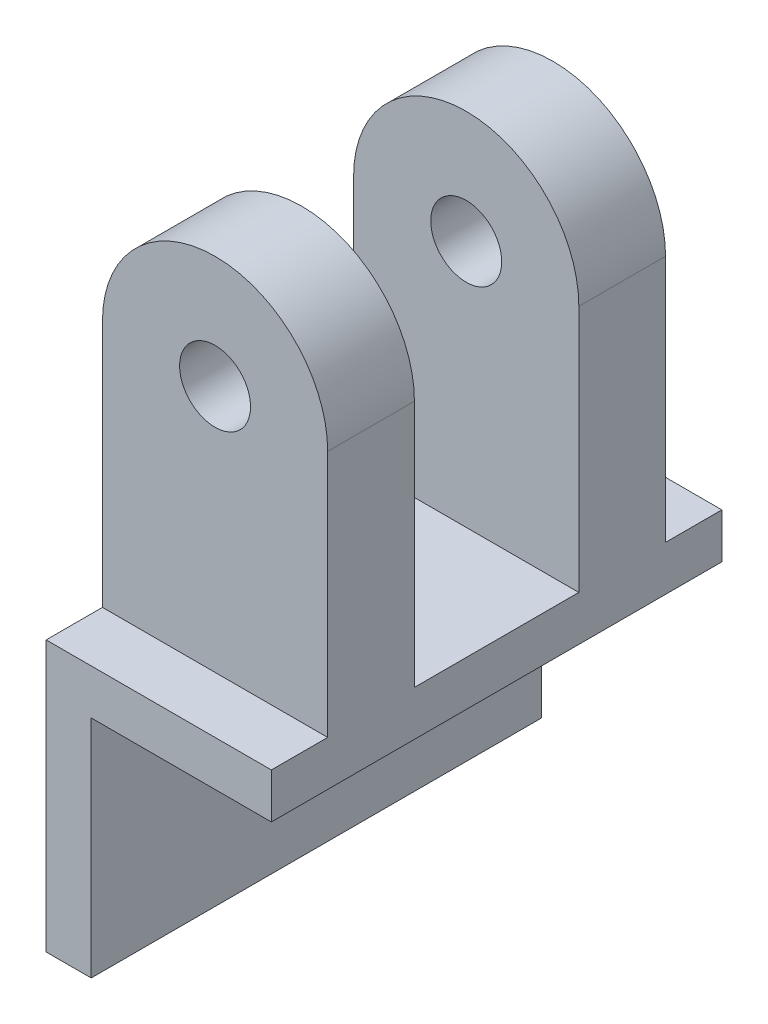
ISO-10303-21;
HEADER;
FILE_DESCRIPTION(('STEP AP214'),'2;1');
FILE_NAME('part.step','',(''),(''),'','','');
FILE_SCHEMA(('AUTOMOTIVE_DESIGN { 1 0 10303 214 1 1 1 1 }'));
ENDSEC;
DATA;
#1=APPLICATION_CONTEXT('core data for automotive mechanical design processes');
#2=APPLICATION_PROTOCOL_DEFINITION('international standard','automotive_design',2000,#1);
#3=PRODUCT_CONTEXT('',#1,'mechanical');
#4=PRODUCT('Part','Part','',(#3));
#5=PRODUCT_RELATED_PRODUCT_CATEGORY('part','',(#4));
#6=PRODUCT_DEFINITION_FORMATION('','',#4);
#7=PRODUCT_DEFINITION_CONTEXT('part definition',#1,'design');
#8=PRODUCT_DEFINITION('design','',#6,#7);
#9=PRODUCT_DEFINITION_SHAPE('','',#8);
#10=(LENGTH_UNIT() NAMED_UNIT(*) SI_UNIT(.MILLI.,.METRE.));
#11=(NAMED_UNIT(*) PLANE_ANGLE_UNIT() SI_UNIT($,.RADIAN.));
#12=(NAMED_UNIT(*) SI_UNIT($,.STERADIAN.) SOLID_ANGLE_UNIT());
#13=UNCERTAINTY_MEASURE_WITH_UNIT(LENGTH_MEASURE(1.E-05),#10,'distance_accuracy_value','');
#14=(GEOMETRIC_REPRESENTATION_CONTEXT(3) GLOBAL_UNCERTAINTY_ASSIGNED_CONTEXT((#13)) GLOBAL_UNIT_ASSIGNED_CONTEXT((#10,
#11,#12)) REPRESENTATION_CONTEXT('',''));
#15=CARTESIAN_POINT('',(0.,0.,0.));
#16=DIRECTION('',(0.,0.,1.));
#17=DIRECTION('',(1.,0.,0.));
#18=AXIS2_PLACEMENT_3D('',#15,#16,#17);
#19=CARTESIAN_POINT('',(12.7,5.08,25.4));
#20=DIRECTION('',(0.,-1.,0.));
#21=DIRECTION('',(1.,0.,0.));
#22=AXIS2_PLACEMENT_3D('',#19,#20,#21);
#23=PLANE('',#22);
#24=DIRECTION('',(1.,0.,0.));
#25=VECTOR('',#24,1.);
#26=CARTESIAN_POINT('',(12.7,5.08,19.05));
#27=LINE('',#26,#25);
#28=CARTESIAN_POINT('',(-12.7,5.07999999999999,19.05));
#29=VERTEX_POINT('',#28);
#30=CARTESIAN_POINT('',(12.7,5.07999999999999,19.05));
#31=VERTEX_POINT('',#30);
#32=EDGE_CURVE('E11',#29,#31,#27,.T.);
#33=ORIENTED_EDGE('',*,*,#32,.F.);
#34=DIRECTION('',(0.,0.,-1.));
#35=VECTOR('',#34,1.);
#36=CARTESIAN_POINT('',(-12.7,5.07999999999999,25.4));
#37=LINE('',#36,#35);
#38=CARTESIAN_POINT('',(-12.7,5.07999999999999,25.4));
#39=VERTEX_POINT('',#38);
#40=EDGE_CURVE('E200',#39,#29,#37,.T.);
#41=ORIENTED_EDGE('',*,*,#40,.F.);
#42=DIRECTION('',(-1.,0.,0.));
#43=VECTOR('',#42,1.);
#44=CARTESIAN_POINT('',(12.7,5.08,25.4));
#45=LINE('',#44,#43);
#46=CARTESIAN_POINT('',(12.7,5.08,25.4));
#47=VERTEX_POINT('',#46);
#48=EDGE_CURVE('E167',#47,#39,#45,.T.);
#49=ORIENTED_EDGE('',*,*,#48,.F.);
#50=DIRECTION('',(0.,0.,-1.));
#51=VECTOR('',#50,1.);
#52=CARTESIAN_POINT('',(12.7,5.08,25.4));
#53=LINE('',#52,#51);
#54=EDGE_CURVE('E205',#47,#31,#53,.T.);
#55=ORIENTED_EDGE('',*,*,#54,.T.);
#56=EDGE_LOOP('',(#33,#41,#49,#55));
#57=FACE_BOUND('',#56,.T.);
#58=ADVANCED_FACE('F34',(#57),#23,.F.);
#59=CARTESIAN_POINT('',(0.,33.02,-19.05));
#60=DIRECTION('',(0.,0.,-1.));
#61=DIRECTION('',(-1.,0.,0.));
#62=AXIS2_PLACEMENT_3D('',#59,#60,#61);
#63=PLANE('',#62);
#64=CARTESIAN_POINT('',(0.,33.02,-19.05));
#65=DIRECTION('',(0.,0.,1.));
#66=DIRECTION('',(1.,0.,0.));
#67=AXIS2_PLACEMENT_3D('',#64,#65,#66);
#68=CIRCLE('',#67,4.0005);
#69=CARTESIAN_POINT('',(-4.0005,33.02,-19.05));
#70=VERTEX_POINT('',#69);
#71=EDGE_CURVE('E210',#70,#70,#68,.T.);
#72=ORIENTED_EDGE('',*,*,#71,.T.);
#73=EDGE_LOOP('',(#72));
#74=FACE_BOUND('',#73,.T.);
#75=DIRECTION('',(0.,1.,0.));
#76=VECTOR('',#75,1.);
#77=CARTESIAN_POINT('',(12.7,33.02,-19.05));
#78=LINE('',#77,#76);
#79=CARTESIAN_POINT('',(12.7,5.07999999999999,-19.05));
#80=VERTEX_POINT('',#79);
#81=CARTESIAN_POINT('',(12.7,33.02,-19.05));
#82=VERTEX_POINT('',#81);
#83=EDGE_CURVE('E57',#80,#82,#78,.T.);
#84=ORIENTED_EDGE('',*,*,#83,.F.);
#85=DIRECTION('',(-1.,0.,0.));
#86=VECTOR('',#85,1.);
#87=CARTESIAN_POINT('',(0.,5.07999999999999,-19.05));
#88=LINE('',#87,#86);
#89=CARTESIAN_POINT('',(-12.7,5.07999999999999,-19.05));
#90=VERTEX_POINT('',#89);
#91=EDGE_CURVE('E208',#80,#90,#88,.T.);
#92=ORIENTED_EDGE('',*,*,#91,.T.);
#93=DIRECTION('',(0.,-1.,0.));
#94=VECTOR('',#93,1.);
#95=CARTESIAN_POINT('',(-12.7,0.,-19.05));
#96=LINE('',#95,#94);
#97=CARTESIAN_POINT('',(-12.7,33.02,-19.05));
#98=VERTEX_POINT('',#97);
#99=EDGE_CURVE('E211',#98,#90,#96,.T.);
#100=ORIENTED_EDGE('',*,*,#99,.F.);
#101=CARTESIAN_POINT('',(0.,33.02,-19.05));
#102=DIRECTION('',(0.,0.,1.));
#103=DIRECTION('',(-1.,0.,0.));
#104=AXIS2_PLACEMENT_3D('',#101,#102,#103);
#105=CIRCLE('',#104,12.7);
#106=EDGE_CURVE('E216',#82,#98,#105,.T.);
#107=ORIENTED_EDGE('',*,*,#106,.F.);
#108=EDGE_LOOP('',(#84,#92,#100,#107));
#109=FACE_BOUND('',#108,.T.);
#110=ADVANCED_FACE('F288',(#74,#109),#63,.T.);
#111=CARTESIAN_POINT('',(12.7,0.,19.05));
#112=DIRECTION('',(0.,1.,0.));
#113=DIRECTION('',(0.,0.,1.));
#114=AXIS2_PLACEMENT_3D('',#111,#112,#113);
#115=PLANE('',#114);
#116=DIRECTION('',(1.,0.,0.));
#117=VECTOR('',#116,1.);
#118=CARTESIAN_POINT('',(-7.62,0.,-25.4));
#119=LINE('',#118,#117);
#120=CARTESIAN_POINT('',(-7.62,0.,-25.4));
#121=VERTEX_POINT('',#120);
#122=CARTESIAN_POINT('',(12.7,0.,-25.4));
#123=VERTEX_POINT('',#122);
#124=EDGE_CURVE('E168',#121,#123,#119,.T.);
#125=ORIENTED_EDGE('',*,*,#124,.T.);
#126=DIRECTION('',(0.,0.,-1.));
#127=VECTOR('',#126,1.);
#128=CARTESIAN_POINT('',(12.7,0.,19.05));
#129=LINE('',#128,#127);
#130=CARTESIAN_POINT('',(12.7,0.,25.4));
#131=VERTEX_POINT('',#130);
#132=EDGE_CURVE('E221',#131,#123,#129,.T.);
#133=ORIENTED_EDGE('',*,*,#132,.F.);
#134=DIRECTION('',(1.,0.,0.));
#135=VECTOR('',#134,1.);
#136=CARTESIAN_POINT('',(-7.62,0.,25.4));
#137=LINE('',#136,#135);
#138=CARTESIAN_POINT('',(-7.62,0.,25.4));
#139=VERTEX_POINT('',#138);
#140=EDGE_CURVE('E177',#139,#131,#137,.T.);
#141=ORIENTED_EDGE('',*,*,#140,.F.);
#142=DIRECTION('',(0.,0.,-1.));
#143=VECTOR('',#142,1.);
#144=CARTESIAN_POINT('',(-7.62,0.,25.4));
#145=LINE('',#144,#143);
#146=EDGE_CURVE('E179',#139,#121,#145,.T.);
#147=ORIENTED_EDGE('',*,*,#146,.T.);
#148=EDGE_LOOP('',(#125,#133,#141,#147));
#149=FACE_BOUND('',#148,.T.);
#150=ADVANCED_FACE('F272',(#149),#115,.F.);
#151=CARTESIAN_POINT('',(0.,33.02,-9.271));
#152=DIRECTION('',(0.,0.,-1.));
#153=DIRECTION('',(-1.,0.,0.));
#154=AXIS2_PLACEMENT_3D('',#151,#152,#153);
#155=PLANE('',#154);
#156=CARTESIAN_POINT('',(0.,33.02,-9.271));
#157=DIRECTION('',(0.,0.,1.));
#158=DIRECTION('',(1.,0.,0.));
#159=AXIS2_PLACEMENT_3D('',#156,#157,#158);
#160=CIRCLE('',#159,4.0005);
#161=CARTESIAN_POINT('',(-4.0005,33.02,-9.271));
#162=VERTEX_POINT('',#161);
#163=EDGE_CURVE('E214',#162,#162,#160,.T.);
#164=ORIENTED_EDGE('',*,*,#163,.F.);
#165=EDGE_LOOP('',(#164));
#166=FACE_BOUND('',#165,.T.);
#167=DIRECTION('',(-1.,0.,0.));
#168=VECTOR('',#167,1.);
#169=CARTESIAN_POINT('',(0.,5.07999999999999,-9.271));
#170=LINE('',#169,#168);
#171=CARTESIAN_POINT('',(12.7,5.07999999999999,-9.271));
#172=VERTEX_POINT('',#171);
#173=CARTESIAN_POINT('',(-12.7,5.07999999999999,-9.271));
#174=VERTEX_POINT('',#173);
#175=EDGE_CURVE('E227',#172,#174,#170,.T.);
#176=ORIENTED_EDGE('',*,*,#175,.F.);
#177=DIRECTION('',(0.,1.,0.));
#178=VECTOR('',#177,1.);
#179=CARTESIAN_POINT('',(12.7,33.02,-9.271));
#180=LINE('',#179,#178);
#181=CARTESIAN_POINT('',(12.7,33.02,-9.271));
#182=VERTEX_POINT('',#181);
#183=EDGE_CURVE('E230',#172,#182,#180,.T.);
#184=ORIENTED_EDGE('',*,*,#183,.T.);
#185=CARTESIAN_POINT('',(0.,33.02,-9.271));
#186=DIRECTION('',(0.,0.,1.));
#187=DIRECTION('',(-1.,0.,0.));
#188=AXIS2_PLACEMENT_3D('',#185,#186,#187);
#189=CIRCLE('',#188,12.7);
#190=CARTESIAN_POINT('',(-12.7,33.02,-9.271));
#191=VERTEX_POINT('',#190);
#192=EDGE_CURVE('E228',#182,#191,#189,.T.);
#193=ORIENTED_EDGE('',*,*,#192,.T.);
#194=DIRECTION('',(0.,-1.,0.));
#195=VECTOR('',#194,1.);
#196=CARTESIAN_POINT('',(-12.7,0.,-9.271));
#197=LINE('',#196,#195);
#198=EDGE_CURVE('E224',#191,#174,#197,.T.);
#199=ORIENTED_EDGE('',*,*,#198,.T.);
#200=EDGE_LOOP('',(#176,#184,#193,#199));
#201=FACE_BOUND('',#200,.T.);
#202=ADVANCED_FACE('F290',(#166,#201),#155,.F.);
#203=CARTESIAN_POINT('',(12.7,33.02,19.05));
#204=DIRECTION('',(-1.,0.,0.));
#205=DIRECTION('',(0.,0.,1.));
#206=AXIS2_PLACEMENT_3D('',#203,#204,#205);
#207=PLANE('',#206);
#208=CARTESIAN_POINT('',(12.7,5.08,9.271));
#209=VERTEX_POINT('',#208);
#210=EDGE_CURVE('E139',#209,#172,#53,.T.);
#211=ORIENTED_EDGE('',*,*,#210,.F.);
#212=DIRECTION('',(0.,1.,0.));
#213=VECTOR('',#212,1.);
#214=CARTESIAN_POINT('',(12.7,33.02,9.271));
#215=LINE('',#214,#213);
#216=CARTESIAN_POINT('',(12.7,33.02,9.271));
#217=VERTEX_POINT('',#216);
#218=EDGE_CURVE('E49',#209,#217,#215,.T.);
#219=ORIENTED_EDGE('',*,*,#218,.T.);
#220=DIRECTION('',(0.,0.,-1.));
#221=VECTOR('',#220,1.);
#222=CARTESIAN_POINT('',(12.7,33.02,19.05));
#223=LINE('',#222,#221);
#224=CARTESIAN_POINT('',(12.7,33.02,19.05));
#225=VERTEX_POINT('',#224);
#226=EDGE_CURVE('E137',#225,#217,#223,.T.);
#227=ORIENTED_EDGE('',*,*,#226,.F.);
#228=DIRECTION('',(0.,1.,0.));
#229=VECTOR('',#228,1.);
#230=CARTESIAN_POINT('',(12.7,33.02,19.05));
#231=LINE('',#230,#229);
#232=EDGE_CURVE('E250',#31,#225,#231,.T.);
#233=ORIENTED_EDGE('',*,*,#232,.F.);
#234=ORIENTED_EDGE('',*,*,#54,.F.);
#235=DIRECTION('',(0.,1.,0.));
#236=VECTOR('',#235,1.);
#237=CARTESIAN_POINT('',(12.7,0.,25.4));
#238=LINE('',#237,#236);
#239=EDGE_CURVE('E164',#131,#47,#238,.T.);
#240=ORIENTED_EDGE('',*,*,#239,.F.);
#241=ORIENTED_EDGE('',*,*,#132,.T.);
#242=DIRECTION('',(0.,1.,0.));
#243=VECTOR('',#242,1.);
#244=CARTESIAN_POINT('',(12.7,0.,-25.4));
#245=LINE('',#244,#243);
#246=CARTESIAN_POINT('',(12.7,5.08,-25.4));
#247=VERTEX_POINT('',#246);
#248=EDGE_CURVE('E154',#123,#247,#245,.T.);
#249=ORIENTED_EDGE('',*,*,#248,.T.);
#250=EDGE_CURVE('E203',#80,#247,#53,.T.);
#251=ORIENTED_EDGE('',*,*,#250,.F.);
#252=ORIENTED_EDGE('',*,*,#83,.T.);
#253=DIRECTION('',(0.,0.,-1.));
#254=VECTOR('',#253,1.);
#255=CARTESIAN_POINT('',(12.7,33.02,19.05));
#256=LINE('',#255,#254);
#257=EDGE_CURVE('E219',#182,#82,#256,.T.);
#258=ORIENTED_EDGE('',*,*,#257,.F.);
#259=ORIENTED_EDGE('',*,*,#183,.F.);
#260=EDGE_LOOP('',(#211,#219,#227,#233,#234,#240,#241,#249,#251,#252,#258,#259));
#261=FACE_BOUND('',#260,.T.);
#262=ADVANCED_FACE('F134',(#261),#207,.F.);
#263=CARTESIAN_POINT('',(0.,33.02,19.05));
#264=DIRECTION('',(0.,0.,-1.));
#265=DIRECTION('',(-1.,0.,0.));
#266=AXIS2_PLACEMENT_3D('',#263,#264,#265);
#267=CYLINDRICAL_SURFACE('',#266,12.7);
#268=DIRECTION('',(0.,0.,-1.));
#269=VECTOR('',#268,1.);
#270=CARTESIAN_POINT('',(-12.7,33.02,19.05));
#271=LINE('',#270,#269);
#272=EDGE_CURVE('E215',#191,#98,#271,.T.);
#273=ORIENTED_EDGE('',*,*,#272,.F.);
#274=ORIENTED_EDGE('',*,*,#192,.F.);
#275=ORIENTED_EDGE('',*,*,#257,.T.);
#276=ORIENTED_EDGE('',*,*,#106,.T.);
#277=EDGE_LOOP('',(#273,#274,#275,#276));
#278=FACE_BOUND('',#277,.T.);
#279=ADVANCED_FACE('F286',(#278),#267,.T.);
#280=CARTESIAN_POINT('',(-12.7,0.,19.05));
#281=DIRECTION('',(1.,0.,0.));
#282=DIRECTION('',(0.,0.,-1.));
#283=AXIS2_PLACEMENT_3D('',#280,#281,#282);
#284=PLANE('',#283);
#285=ORIENTED_EDGE('',*,*,#40,.T.);
#286=DIRECTION('',(0.,-1.,0.));
#287=VECTOR('',#286,1.);
#288=CARTESIAN_POINT('',(-12.7,0.,19.05));
#289=LINE('',#288,#287);
#290=CARTESIAN_POINT('',(-12.7,33.02,19.05));
#291=VERTEX_POINT('',#290);
#292=EDGE_CURVE('E160',#291,#29,#289,.T.);
#293=ORIENTED_EDGE('',*,*,#292,.F.);
#294=DIRECTION('',(0.,0.,-1.));
#295=VECTOR('',#294,1.);
#296=CARTESIAN_POINT('',(-12.7,33.02,19.05));
#297=LINE('',#296,#295);
#298=CARTESIAN_POINT('',(-12.7,33.02,9.271));
#299=VERTEX_POINT('',#298);
#300=EDGE_CURVE('E155',#291,#299,#297,.T.);
#301=ORIENTED_EDGE('',*,*,#300,.T.);
#302=DIRECTION('',(0.,-1.,0.));
#303=VECTOR('',#302,1.);
#304=CARTESIAN_POINT('',(-12.7,0.,9.271));
#305=LINE('',#304,#303);
#306=CARTESIAN_POINT('',(-12.7,5.07999999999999,9.271));
#307=VERTEX_POINT('',#306);
#308=EDGE_CURVE('E146',#299,#307,#305,.T.);
#309=ORIENTED_EDGE('',*,*,#308,.T.);
#310=EDGE_CURVE('E204',#307,#174,#37,.T.);
#311=ORIENTED_EDGE('',*,*,#310,.T.);
#312=ORIENTED_EDGE('',*,*,#198,.F.);
#313=ORIENTED_EDGE('',*,*,#272,.T.);
#314=ORIENTED_EDGE('',*,*,#99,.T.);
#315=CARTESIAN_POINT('',(-12.7,5.07999999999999,-25.4));
#316=VERTEX_POINT('',#315);
#317=EDGE_CURVE('E199',#90,#316,#37,.T.);
#318=ORIENTED_EDGE('',*,*,#317,.T.);
#319=DIRECTION('',(0.,-1.,0.));
#320=VECTOR('',#319,1.);
#321=CARTESIAN_POINT('',(-12.7,5.07999999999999,-25.4));
#322=LINE('',#321,#320);
#323=CARTESIAN_POINT('',(-12.7,-25.4,-25.4));
#324=VERTEX_POINT('',#323);
#325=EDGE_CURVE('E183',#316,#324,#322,.T.);
#326=ORIENTED_EDGE('',*,*,#325,.T.);
#327=DIRECTION('',(0.,0.,-1.));
#328=VECTOR('',#327,1.);
#329=CARTESIAN_POINT('',(-12.7,-25.4,25.4));
#330=LINE('',#329,#328);
#331=CARTESIAN_POINT('',(-12.7,-25.4,25.4));
#332=VERTEX_POINT('',#331);
#333=EDGE_CURVE('E196',#332,#324,#330,.T.);
#334=ORIENTED_EDGE('',*,*,#333,.F.);
#335=DIRECTION('',(0.,-1.,0.));
#336=VECTOR('',#335,1.);
#337=CARTESIAN_POINT('',(-12.7,5.07999999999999,25.4));
#338=LINE('',#337,#336);
#339=EDGE_CURVE('E170',#39,#332,#338,.T.);
#340=ORIENTED_EDGE('',*,*,#339,.F.);
#341=EDGE_LOOP('',(#285,#293,#301,#309,#311,#312,#313,#314,#318,#326,#334,#340));
#342=FACE_BOUND('',#341,.T.);
#343=ADVANCED_FACE('F244',(#342),#284,.F.);
#344=CARTESIAN_POINT('',(0.,33.02,19.05));
#345=DIRECTION('',(0.,0.,-1.));
#346=DIRECTION('',(-1.,0.,0.));
#347=AXIS2_PLACEMENT_3D('',#344,#345,#346);
#348=CYLINDRICAL_SURFACE('',#347,4.0005);
#349=CARTESIAN_POINT('',(-4.0005,33.02,-9.271));
#350=CARTESIAN_POINT('',(-4.0005,33.02,-9.37286458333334));
#351=CARTESIAN_POINT('',(-4.0005,33.02,-9.47472916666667));
#352=CARTESIAN_POINT('',(-4.0005,33.02,-9.67845833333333));
#353=CARTESIAN_POINT('',(-4.0005,33.02,-9.78032291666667));
#354=CARTESIAN_POINT('',(-4.0005,33.02,-9.98405208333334));
#355=CARTESIAN_POINT('',(-4.0005,33.02,-10.0859166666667));
#356=CARTESIAN_POINT('',(-4.0005,33.02,-10.2896458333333));
#357=CARTESIAN_POINT('',(-4.0005,33.02,-10.3915104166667));
#358=CARTESIAN_POINT('',(-4.0005,33.02,-10.5952395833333));
#359=CARTESIAN_POINT('',(-4.0005,33.02,-10.6971041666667));
#360=CARTESIAN_POINT('',(-4.0005,33.02,-10.9008333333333));
#361=CARTESIAN_POINT('',(-4.0005,33.02,-11.0026979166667));
#362=CARTESIAN_POINT('',(-4.0005,33.02,-11.2064270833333));
#363=CARTESIAN_POINT('',(-4.0005,33.02,-11.3082916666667));
#364=CARTESIAN_POINT('',(-4.0005,33.02,-11.5120208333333));
#365=CARTESIAN_POINT('',(-4.0005,33.02,-11.6138854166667));
#366=CARTESIAN_POINT('',(-4.0005,33.02,-11.8176145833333));
#367=CARTESIAN_POINT('',(-4.0005,33.02,-11.9194791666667));
#368=CARTESIAN_POINT('',(-4.0005,33.02,-12.1232083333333));
#369=CARTESIAN_POINT('',(-4.0005,33.02,-12.2250729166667));
#370=CARTESIAN_POINT('',(-4.0005,33.02,-12.4288020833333));
#371=CARTESIAN_POINT('',(-4.0005,33.02,-12.5306666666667));
#372=CARTESIAN_POINT('',(-4.0005,33.02,-12.7343958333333));
#373=CARTESIAN_POINT('',(-4.0005,33.02,-12.8362604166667));
#374=CARTESIAN_POINT('',(-4.0005,33.02,-13.0399895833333));
#375=CARTESIAN_POINT('',(-4.0005,33.02,-13.1418541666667));
#376=CARTESIAN_POINT('',(-4.0005,33.02,-13.3455833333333));
#377=CARTESIAN_POINT('',(-4.0005,33.02,-13.4474479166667));
#378=CARTESIAN_POINT('',(-4.0005,33.02,-13.6511770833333));
#379=CARTESIAN_POINT('',(-4.0005,33.02,-13.7530416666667));
#380=CARTESIAN_POINT('',(-4.0005,33.02,-13.9567708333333));
#381=CARTESIAN_POINT('',(-4.0005,33.02,-14.0586354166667));
#382=CARTESIAN_POINT('',(-4.0005,33.02,-14.2623645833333));
#383=CARTESIAN_POINT('',(-4.0005,33.02,-14.3642291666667));
#384=CARTESIAN_POINT('',(-4.0005,33.02,-14.5679583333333));
#385=CARTESIAN_POINT('',(-4.0005,33.02,-14.6698229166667));
#386=CARTESIAN_POINT('',(-4.0005,33.02,-14.8735520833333));
#387=CARTESIAN_POINT('',(-4.0005,33.02,-14.9754166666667));
#388=CARTESIAN_POINT('',(-4.0005,33.02,-15.1791458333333));
#389=CARTESIAN_POINT('',(-4.0005,33.02,-15.2810104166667));
#390=CARTESIAN_POINT('',(-4.0005,33.02,-15.4847395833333));
#391=CARTESIAN_POINT('',(-4.0005,33.02,-15.5866041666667));
#392=CARTESIAN_POINT('',(-4.0005,33.02,-15.7903333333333));
#393=CARTESIAN_POINT('',(-4.0005,33.02,-15.8921979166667));
#394=CARTESIAN_POINT('',(-4.0005,33.02,-16.0959270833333));
#395=CARTESIAN_POINT('',(-4.0005,33.02,-16.1977916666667));
#396=CARTESIAN_POINT('',(-4.0005,33.02,-16.4015208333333));
#397=CARTESIAN_POINT('',(-4.0005,33.02,-16.5033854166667));
#398=CARTESIAN_POINT('',(-4.0005,33.02,-16.7071145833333));
#399=CARTESIAN_POINT('',(-4.0005,33.02,-16.8089791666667));
#400=CARTESIAN_POINT('',(-4.0005,33.02,-17.0127083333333));
#401=CARTESIAN_POINT('',(-4.0005,33.02,-17.1145729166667));
#402=CARTESIAN_POINT('',(-4.0005,33.02,-17.3183020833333));
#403=CARTESIAN_POINT('',(-4.0005,33.02,-17.4201666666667));
#404=CARTESIAN_POINT('',(-4.0005,33.02,-17.6238958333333));
#405=CARTESIAN_POINT('',(-4.0005,33.02,-17.7257604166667));
#406=CARTESIAN_POINT('',(-4.0005,33.02,-17.9294895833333));
#407=CARTESIAN_POINT('',(-4.0005,33.02,-18.0313541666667));
#408=CARTESIAN_POINT('',(-4.0005,33.02,-18.2350833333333));
#409=CARTESIAN_POINT('',(-4.0005,33.02,-18.3369479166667));
#410=CARTESIAN_POINT('',(-4.0005,33.02,-18.5406770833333));
#411=CARTESIAN_POINT('',(-4.0005,33.02,-18.6425416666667));
#412=CARTESIAN_POINT('',(-4.0005,33.02,-18.8462708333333));
#413=CARTESIAN_POINT('',(-4.0005,33.02,-18.9481354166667));
#414=CARTESIAN_POINT('',(-4.0005,33.02,-19.05));
#415=B_SPLINE_CURVE_WITH_KNOTS('',3,(#349,#350,#351,#352,#353,#354,#355,#356,#357,#358,#359,
#360,#361,#362,#363,#364,#365,#366,#367,#368,#369,#370,#371,#372,#373,#374,#375,#376,#377,#378,
#379,#380,#381,#382,#383,#384,#385,#386,#387,#388,#389,#390,#391,#392,#393,#394,#395,#396,#397,
#398,#399,#400,#401,#402,#403,#404,#405,#406,#407,#408,#409,#410,#411,#412,#413,#414),
.UNSPECIFIED.,.F.,.F.,(4,2,2,2,2,2,2,2,2,2,2,2,2,2,2,2,2,2,2,2,2,2,2,2,2,2,2,2,2,2,2,2,4),(0.,
0.305593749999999,0.611187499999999,0.916781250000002,1.222375,1.52796875,1.8335625,2.13915625,
2.44475,2.75034375,3.0559375,3.36153125,3.667125,3.97271875,4.2783125,4.58390624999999,
4.88949999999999,5.19509375,5.5006875,5.80628125,6.111875,6.41746875,6.7230625,7.02865625,
7.33425,7.63984375,7.9454375,8.25103125,8.556625,8.86221875,9.1678125,9.47340625,9.779),.UNSPECIFIED.);
#416=EDGE_CURVE('BSEAM36',#162,#70,#415,.T.);
#417=ORIENTED_EDGE('',*,*,#163,.T.);
#418=ORIENTED_EDGE('',*,*,#71,.F.);
#419=ORIENTED_EDGE('',*,*,#416,.T.);
#420=ORIENTED_EDGE('',*,*,#416,.F.);
#421=EDGE_LOOP('',(#417,#419,#418,#420));
#422=FACE_BOUND('',#421,.T.);
#423=ADVANCED_FACE('F36',(#422),#348,.F.);
#424=ORIENTED_EDGE('',*,*,#310,.F.);
#425=DIRECTION('',(1.,0.,0.));
#426=VECTOR('',#425,1.);
#427=CARTESIAN_POINT('',(12.7,5.08,9.271));
#428=LINE('',#427,#426);
#429=EDGE_CURVE('E42',#307,#209,#428,.T.);
#430=ORIENTED_EDGE('',*,*,#429,.T.);
#431=ORIENTED_EDGE('',*,*,#210,.T.);
#432=ORIENTED_EDGE('',*,*,#175,.T.);
#433=EDGE_LOOP('',(#424,#430,#431,#432));
#434=FACE_BOUND('',#433,.T.);
#435=ADVANCED_FACE('F241',(#434),#23,.F.);
#436=ORIENTED_EDGE('',*,*,#91,.F.);
#437=ORIENTED_EDGE('',*,*,#250,.T.);
#438=DIRECTION('',(-1.,0.,0.));
#439=VECTOR('',#438,1.);
#440=CARTESIAN_POINT('',(12.7,5.08,-25.4));
#441=LINE('',#440,#439);
#442=EDGE_CURVE('E158',#247,#316,#441,.T.);
#443=ORIENTED_EDGE('',*,*,#442,.T.);
#444=ORIENTED_EDGE('',*,*,#317,.F.);
#445=EDGE_LOOP('',(#436,#437,#443,#444));
#446=FACE_BOUND('',#445,.T.);
#447=ADVANCED_FACE('F281',(#446),#23,.F.);
#448=CARTESIAN_POINT('',(-12.7,-25.4,25.4));
#449=DIRECTION('',(0.,1.,0.));
#450=DIRECTION('',(0.,0.,1.));
#451=AXIS2_PLACEMENT_3D('',#448,#449,#450);
#452=PLANE('',#451);
#453=DIRECTION('',(1.,0.,0.));
#454=VECTOR('',#453,1.);
#455=CARTESIAN_POINT('',(-12.7,-25.4,-25.4));
#456=LINE('',#455,#454);
#457=CARTESIAN_POINT('',(-7.62,-25.4,-25.4));
#458=VERTEX_POINT('',#457);
#459=EDGE_CURVE('E185',#324,#458,#456,.T.);
#460=ORIENTED_EDGE('',*,*,#459,.T.);
#461=DIRECTION('',(0.,0.,-1.));
#462=VECTOR('',#461,1.);
#463=CARTESIAN_POINT('',(-7.62,-25.4,25.4));
#464=LINE('',#463,#462);
#465=CARTESIAN_POINT('',(-7.62,-25.4,25.4));
#466=VERTEX_POINT('',#465);
#467=EDGE_CURVE('E193',#466,#458,#464,.T.);
#468=ORIENTED_EDGE('',*,*,#467,.F.);
#469=DIRECTION('',(1.,0.,0.));
#470=VECTOR('',#469,1.);
#471=CARTESIAN_POINT('',(-12.7,-25.4,25.4));
#472=LINE('',#471,#470);
#473=EDGE_CURVE('E172',#332,#466,#472,.T.);
#474=ORIENTED_EDGE('',*,*,#473,.F.);
#475=ORIENTED_EDGE('',*,*,#333,.T.);
#476=EDGE_LOOP('',(#460,#468,#474,#475));
#477=FACE_BOUND('',#476,.T.);
#478=ADVANCED_FACE('F310',(#477),#452,.F.);
#479=CARTESIAN_POINT('',(-7.62,-25.4,25.4));
#480=DIRECTION('',(-1.,0.,0.));
#481=DIRECTION('',(0.,0.,1.));
#482=AXIS2_PLACEMENT_3D('',#479,#480,#481);
#483=PLANE('',#482);
#484=DIRECTION('',(0.,1.,0.));
#485=VECTOR('',#484,1.);
#486=CARTESIAN_POINT('',(-7.62,-25.4,-25.4));
#487=LINE('',#486,#485);
#488=EDGE_CURVE('E187',#458,#121,#487,.T.);
#489=ORIENTED_EDGE('',*,*,#488,.T.);
#490=ORIENTED_EDGE('',*,*,#146,.F.);
#491=DIRECTION('',(0.,1.,0.));
#492=VECTOR('',#491,1.);
#493=CARTESIAN_POINT('',(-7.62,-25.4,25.4));
#494=LINE('',#493,#492);
#495=EDGE_CURVE('E174',#466,#139,#494,.T.);
#496=ORIENTED_EDGE('',*,*,#495,.F.);
#497=ORIENTED_EDGE('',*,*,#467,.T.);
#498=EDGE_LOOP('',(#489,#490,#496,#497));
#499=FACE_BOUND('',#498,.T.);
#500=ADVANCED_FACE('F314',(#499),#483,.F.);
#501=CARTESIAN_POINT('',(0.,0.,25.4));
#502=DIRECTION('',(0.,0.,1.));
#503=DIRECTION('',(1.,0.,0.));
#504=AXIS2_PLACEMENT_3D('',#501,#502,#503);
#505=PLANE('',#504);
#506=ORIENTED_EDGE('',*,*,#239,.T.);
#507=ORIENTED_EDGE('',*,*,#48,.T.);
#508=ORIENTED_EDGE('',*,*,#339,.T.);
#509=ORIENTED_EDGE('',*,*,#473,.T.);
#510=ORIENTED_EDGE('',*,*,#495,.T.);
#511=ORIENTED_EDGE('',*,*,#140,.T.);
#512=EDGE_LOOP('',(#506,#507,#508,#509,#510,#511));
#513=FACE_BOUND('',#512,.T.);
#514=ADVANCED_FACE('F264',(#513),#505,.T.);
#515=CARTESIAN_POINT('',(0.,0.,-25.4));
#516=DIRECTION('',(0.,0.,1.));
#517=DIRECTION('',(1.,0.,0.));
#518=AXIS2_PLACEMENT_3D('',#515,#516,#517);
#519=PLANE('',#518);
#520=ORIENTED_EDGE('',*,*,#248,.F.);
#521=ORIENTED_EDGE('',*,*,#124,.F.);
#522=ORIENTED_EDGE('',*,*,#488,.F.);
#523=ORIENTED_EDGE('',*,*,#459,.F.);
#524=ORIENTED_EDGE('',*,*,#325,.F.);
#525=ORIENTED_EDGE('',*,*,#442,.F.);
#526=EDGE_LOOP('',(#520,#521,#522,#523,#524,#525));
#527=FACE_BOUND('',#526,.T.);
#528=ADVANCED_FACE('F276',(#527),#519,.F.);
#529=CARTESIAN_POINT('',(0.,33.02,19.05));
#530=DIRECTION('',(0.,0.,-1.));
#531=DIRECTION('',(-1.,0.,0.));
#532=AXIS2_PLACEMENT_3D('',#529,#530,#531);
#533=PLANE('',#532);
#534=CARTESIAN_POINT('',(0.,33.02,19.05));
#535=DIRECTION('',(0.,0.,1.));
#536=DIRECTION('',(1.,0.,0.));
#537=AXIS2_PLACEMENT_3D('',#534,#535,#536);
#538=CIRCLE('',#537,4.0005);
#539=CARTESIAN_POINT('',(-4.0005,33.02,19.05));
#540=VERTEX_POINT('',#539);
#541=EDGE_CURVE('E247',#540,#540,#538,.T.);
#542=ORIENTED_EDGE('',*,*,#541,.F.);
#543=EDGE_LOOP('',(#542));
#544=FACE_BOUND('',#543,.T.);
#545=ORIENTED_EDGE('',*,*,#292,.T.);
#546=ORIENTED_EDGE('',*,*,#32,.T.);
#547=ORIENTED_EDGE('',*,*,#232,.T.);
#548=CARTESIAN_POINT('',(0.,33.02,19.05));
#549=DIRECTION('',(0.,0.,1.));
#550=DIRECTION('',(-1.,0.,0.));
#551=AXIS2_PLACEMENT_3D('',#548,#549,#550);
#552=CIRCLE('',#551,12.7);
#553=EDGE_CURVE('E153',#225,#291,#552,.T.);
#554=ORIENTED_EDGE('',*,*,#553,.T.);
#555=EDGE_LOOP('',(#545,#546,#547,#554));
#556=FACE_BOUND('',#555,.T.);
#557=ADVANCED_FACE('F256',(#544,#556),#533,.F.);
#558=CARTESIAN_POINT('',(0.,33.02,9.271));
#559=DIRECTION('',(0.,0.,-1.));
#560=DIRECTION('',(-1.,0.,0.));
#561=AXIS2_PLACEMENT_3D('',#558,#559,#560);
#562=PLANE('',#561);
#563=CARTESIAN_POINT('',(0.,33.02,9.271));
#564=DIRECTION('',(0.,0.,1.));
#565=DIRECTION('',(1.,0.,0.));
#566=AXIS2_PLACEMENT_3D('',#563,#564,#565);
#567=CIRCLE('',#566,4.0005);
#568=CARTESIAN_POINT('',(-4.0005,33.02,9.271));
#569=VERTEX_POINT('',#568);
#570=EDGE_CURVE('E141',#569,#569,#567,.T.);
#571=ORIENTED_EDGE('',*,*,#570,.T.);
#572=EDGE_LOOP('',(#571));
#573=FACE_BOUND('',#572,.T.);
#574=ORIENTED_EDGE('',*,*,#429,.F.);
#575=ORIENTED_EDGE('',*,*,#308,.F.);
#576=CARTESIAN_POINT('',(0.,33.02,9.271));
#577=DIRECTION('',(0.,0.,1.));
#578=DIRECTION('',(-1.,0.,0.));
#579=AXIS2_PLACEMENT_3D('',#576,#577,#578);
#580=CIRCLE('',#579,12.7);
#581=EDGE_CURVE('E140',#217,#299,#580,.T.);
#582=ORIENTED_EDGE('',*,*,#581,.F.);
#583=ORIENTED_EDGE('',*,*,#218,.F.);
#584=EDGE_LOOP('',(#574,#575,#582,#583));
#585=FACE_BOUND('',#584,.T.);
#586=ADVANCED_FACE('F144',(#573,#585),#562,.T.);
#587=CARTESIAN_POINT('',(0.,33.02,19.05));
#588=DIRECTION('',(0.,0.,-1.));
#589=DIRECTION('',(-1.,0.,0.));
#590=AXIS2_PLACEMENT_3D('',#587,#588,#589);
#591=CYLINDRICAL_SURFACE('',#590,12.7);
#592=ORIENTED_EDGE('',*,*,#581,.T.);
#593=ORIENTED_EDGE('',*,*,#300,.F.);
#594=ORIENTED_EDGE('',*,*,#553,.F.);
#595=ORIENTED_EDGE('',*,*,#226,.T.);
#596=EDGE_LOOP('',(#592,#593,#594,#595));
#597=FACE_BOUND('',#596,.T.);
#598=ADVANCED_FACE('F152',(#597),#591,.T.);
#599=CARTESIAN_POINT('',(0.,33.02,19.05));
#600=DIRECTION('',(0.,0.,-1.));
#601=DIRECTION('',(-1.,0.,0.));
#602=AXIS2_PLACEMENT_3D('',#599,#600,#601);
#603=CYLINDRICAL_SURFACE('',#602,4.0005);
#604=CARTESIAN_POINT('',(-4.0005,33.02,19.05));
#605=CARTESIAN_POINT('',(-4.0005,33.02,18.9481354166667));
#606=CARTESIAN_POINT('',(-4.0005,33.02,18.8462708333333));
#607=CARTESIAN_POINT('',(-4.0005,33.02,18.6425416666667));
#608=CARTESIAN_POINT('',(-4.0005,33.02,18.5406770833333));
#609=CARTESIAN_POINT('',(-4.0005,33.02,18.3369479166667));
#610=CARTESIAN_POINT('',(-4.0005,33.02,18.2350833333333));
#611=CARTESIAN_POINT('',(-4.0005,33.02,18.0313541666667));
#612=CARTESIAN_POINT('',(-4.0005,33.02,17.9294895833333));
#613=CARTESIAN_POINT('',(-4.0005,33.02,17.7257604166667));
#614=CARTESIAN_POINT('',(-4.0005,33.02,17.6238958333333));
#615=CARTESIAN_POINT('',(-4.0005,33.02,17.4201666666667));
#616=CARTESIAN_POINT('',(-4.0005,33.02,17.3183020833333));
#617=CARTESIAN_POINT('',(-4.0005,33.02,17.1145729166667));
#618=CARTESIAN_POINT('',(-4.0005,33.02,17.0127083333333));
#619=CARTESIAN_POINT('',(-4.0005,33.02,16.8089791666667));
#620=CARTESIAN_POINT('',(-4.0005,33.02,16.7071145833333));
#621=CARTESIAN_POINT('',(-4.0005,33.02,16.5033854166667));
#622=CARTESIAN_POINT('',(-4.0005,33.02,16.4015208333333));
#623=CARTESIAN_POINT('',(-4.0005,33.02,16.1977916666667));
#624=CARTESIAN_POINT('',(-4.0005,33.02,16.0959270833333));
#625=CARTESIAN_POINT('',(-4.0005,33.02,15.8921979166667));
#626=CARTESIAN_POINT('',(-4.0005,33.02,15.7903333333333));
#627=CARTESIAN_POINT('',(-4.0005,33.02,15.5866041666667));
#628=CARTESIAN_POINT('',(-4.0005,33.02,15.4847395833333));
#629=CARTESIAN_POINT('',(-4.0005,33.02,15.2810104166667));
#630=CARTESIAN_POINT('',(-4.0005,33.02,15.1791458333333));
#631=CARTESIAN_POINT('',(-4.0005,33.02,14.9754166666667));
#632=CARTESIAN_POINT('',(-4.0005,33.02,14.8735520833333));
#633=CARTESIAN_POINT('',(-4.0005,33.02,14.6698229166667));
#634=CARTESIAN_POINT('',(-4.0005,33.02,14.5679583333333));
#635=CARTESIAN_POINT('',(-4.0005,33.02,14.3642291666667));
#636=CARTESIAN_POINT('',(-4.0005,33.02,14.2623645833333));
#637=CARTESIAN_POINT('',(-4.0005,33.02,14.0586354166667));
#638=CARTESIAN_POINT('',(-4.0005,33.02,13.9567708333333));
#639=CARTESIAN_POINT('',(-4.0005,33.02,13.7530416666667));
#640=CARTESIAN_POINT('',(-4.0005,33.02,13.6511770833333));
#641=CARTESIAN_POINT('',(-4.0005,33.02,13.4474479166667));
#642=CARTESIAN_POINT('',(-4.0005,33.02,13.3455833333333));
#643=CARTESIAN_POINT('',(-4.0005,33.02,13.1418541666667));
#644=CARTESIAN_POINT('',(-4.0005,33.02,13.0399895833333));
#645=CARTESIAN_POINT('',(-4.0005,33.02,12.8362604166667));
#646=CARTESIAN_POINT('',(-4.0005,33.02,12.7343958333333));
#647=CARTESIAN_POINT('',(-4.0005,33.02,12.5306666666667));
#648=CARTESIAN_POINT('',(-4.0005,33.02,12.4288020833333));
#649=CARTESIAN_POINT('',(-4.0005,33.02,12.2250729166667));
#650=CARTESIAN_POINT('',(-4.0005,33.02,12.1232083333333));
#651=CARTESIAN_POINT('',(-4.0005,33.02,11.9194791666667));
#652=CARTESIAN_POINT('',(-4.0005,33.02,11.8176145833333));
#653=CARTESIAN_POINT('',(-4.0005,33.02,11.6138854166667));
#654=CARTESIAN_POINT('',(-4.0005,33.02,11.5120208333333));
#655=CARTESIAN_POINT('',(-4.0005,33.02,11.3082916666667));
#656=CARTESIAN_POINT('',(-4.0005,33.02,11.2064270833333));
#657=CARTESIAN_POINT('',(-4.0005,33.02,11.0026979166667));
#658=CARTESIAN_POINT('',(-4.0005,33.02,10.9008333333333));
#659=CARTESIAN_POINT('',(-4.0005,33.02,10.6971041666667));
#660=CARTESIAN_POINT('',(-4.0005,33.02,10.5952395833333));
#661=CARTESIAN_POINT('',(-4.0005,33.02,10.3915104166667));
#662=CARTESIAN_POINT('',(-4.0005,33.02,10.2896458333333));
#663=CARTESIAN_POINT('',(-4.0005,33.02,10.0859166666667));
#664=CARTESIAN_POINT('',(-4.0005,33.02,9.98405208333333));
#665=CARTESIAN_POINT('',(-4.0005,33.02,9.78032291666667));
#666=CARTESIAN_POINT('',(-4.0005,33.02,9.67845833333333));
#667=CARTESIAN_POINT('',(-4.0005,33.02,9.47472916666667));
#668=CARTESIAN_POINT('',(-4.0005,33.02,9.37286458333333));
#669=CARTESIAN_POINT('',(-4.0005,33.02,9.271));
#670=B_SPLINE_CURVE_WITH_KNOTS('',3,(#604,#605,#606,#607,#608,#609,#610,#611,#612,#613,#614,
#615,#616,#617,#618,#619,#620,#621,#622,#623,#624,#625,#626,#627,#628,#629,#630,#631,#632,#633,
#634,#635,#636,#637,#638,#639,#640,#641,#642,#643,#644,#645,#646,#647,#648,#649,#650,#651,#652,
#653,#654,#655,#656,#657,#658,#659,#660,#661,#662,#663,#664,#665,#666,#667,#668,#669),
.UNSPECIFIED.,.F.,.F.,(4,2,2,2,2,2,2,2,2,2,2,2,2,2,2,2,2,2,2,2,2,2,2,2,2,2,2,2,2,2,2,2,4),(0.,
0.305593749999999,0.611187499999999,0.916781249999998,1.222375,1.52796875,1.8335625,2.13915625,
2.44475,2.75034375,3.0559375,3.36153125,3.667125,3.97271875,4.2783125,4.58390625,4.8895,
5.19509375,5.5006875,5.80628125,6.111875,6.41746875,6.7230625,7.02865625,7.33425,7.63984375,
7.9454375,8.25103125,8.556625,8.86221875,9.1678125,9.47340625,9.779),.UNSPECIFIED.);
#671=EDGE_CURVE('BSEAM328',#540,#569,#670,.T.);
#672=ORIENTED_EDGE('',*,*,#541,.T.);
#673=ORIENTED_EDGE('',*,*,#570,.F.);
#674=ORIENTED_EDGE('',*,*,#671,.T.);
#675=ORIENTED_EDGE('',*,*,#671,.F.);
#676=EDGE_LOOP('',(#672,#674,#673,#675));
#677=FACE_BOUND('',#676,.T.);
#678=ADVANCED_FACE('F328',(#677),#603,.F.);
#679=CLOSED_SHELL('',(#58,#110,#150,#202,#262,#279,#343,#423,#435,#447,#478,#500,#514,#528,#557,
#586,#598,#678));
#680=MANIFOLD_SOLID_BREP('B2',#679);
#681=ADVANCED_BREP_SHAPE_REPRESENTATION('',(#18,#680),#14);
#682=SHAPE_DEFINITION_REPRESENTATION(#9,#681);
ENDSEC;
END-ISO-10303-21;
